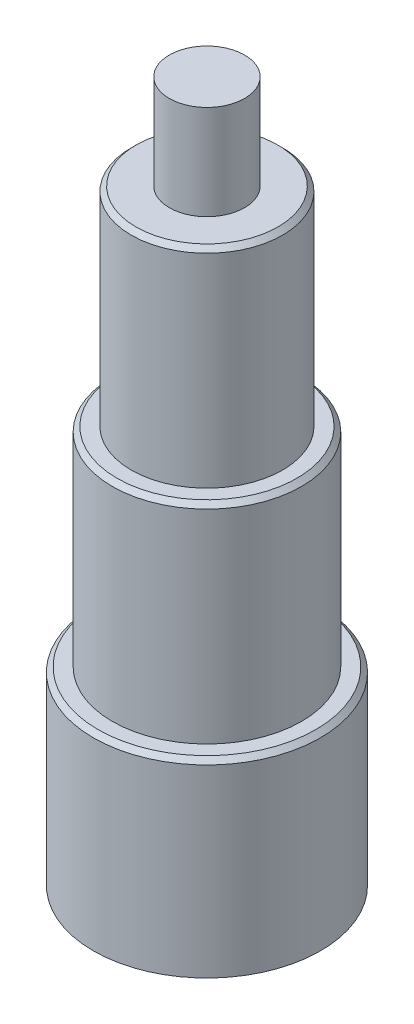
ISO-10303-21;
HEADER;
FILE_DESCRIPTION(('STEP AP214'),'2;1');
FILE_NAME('part.step','',(''),(''),'','','');
FILE_SCHEMA(('AUTOMOTIVE_DESIGN { 1 0 10303 214 1 1 1 1 }'));
ENDSEC;
DATA;
#1=APPLICATION_CONTEXT('core data for automotive mechanical design processes');
#2=APPLICATION_PROTOCOL_DEFINITION('international standard','automotive_design',2000,#1);
#3=PRODUCT_CONTEXT('',#1,'mechanical');
#4=PRODUCT('Part','Part','',(#3));
#5=PRODUCT_RELATED_PRODUCT_CATEGORY('part','',(#4));
#6=PRODUCT_DEFINITION_FORMATION('','',#4);
#7=PRODUCT_DEFINITION_CONTEXT('part definition',#1,'design');
#8=PRODUCT_DEFINITION('design','',#6,#7);
#9=PRODUCT_DEFINITION_SHAPE('','',#8);
#10=(LENGTH_UNIT() NAMED_UNIT(*) SI_UNIT(.MILLI.,.METRE.));
#11=(NAMED_UNIT(*) PLANE_ANGLE_UNIT() SI_UNIT($,.RADIAN.));
#12=(NAMED_UNIT(*) SI_UNIT($,.STERADIAN.) SOLID_ANGLE_UNIT());
#13=UNCERTAINTY_MEASURE_WITH_UNIT(LENGTH_MEASURE(1.E-05),#10,'distance_accuracy_value','');
#14=(GEOMETRIC_REPRESENTATION_CONTEXT(3) GLOBAL_UNCERTAINTY_ASSIGNED_CONTEXT((#13)) GLOBAL_UNIT_ASSIGNED_CONTEXT((#10,
#11,#12)) REPRESENTATION_CONTEXT('',''));
#15=CARTESIAN_POINT('',(0.,0.,0.));
#16=DIRECTION('',(0.,0.,1.));
#17=DIRECTION('',(1.,0.,0.));
#18=AXIS2_PLACEMENT_3D('',#15,#16,#17);
#19=CARTESIAN_POINT('',(0.,32.,0.));
#20=DIRECTION('',(0.,1.,0.));
#21=DIRECTION('',(0.,0.,1.));
#22=AXIS2_PLACEMENT_3D('',#19,#20,#21);
#23=PLANE('',#22);
#24=CARTESIAN_POINT('',(0.,32.,0.));
#25=DIRECTION('',(0.,1.,0.));
#26=DIRECTION('',(0.,0.,1.));
#27=AXIS2_PLACEMENT_3D('',#24,#25,#26);
#28=CIRCLE('',#27,3.75);
#29=CARTESIAN_POINT('',(0.,32.,3.75));
#30=VERTEX_POINT('',#29);
#31=EDGE_CURVE('E75',#30,#30,#28,.T.);
#32=ORIENTED_EDGE('',*,*,#31,.T.);
#33=EDGE_LOOP('',(#32));
#34=FACE_BOUND('',#33,.T.);
#35=CARTESIAN_POINT('',(0.,32.,0.));
#36=DIRECTION('',(0.,1.,0.));
#37=DIRECTION('',(0.,0.,1.));
#38=AXIS2_PLACEMENT_3D('',#35,#36,#37);
#39=CIRCLE('',#38,1.989);
#40=CARTESIAN_POINT('',(0.,32.,1.989));
#41=VERTEX_POINT('',#40);
#42=EDGE_CURVE('E55',#41,#41,#39,.T.);
#43=ORIENTED_EDGE('',*,*,#42,.F.);
#44=EDGE_LOOP('',(#43));
#45=FACE_BOUND('',#44,.T.);
#46=ADVANCED_FACE('F36',(#34,#45),#23,.T.);
#47=CARTESIAN_POINT('',(0.,21.,0.));
#48=DIRECTION('',(0.,1.,0.));
#49=DIRECTION('',(0.,0.,1.));
#50=AXIS2_PLACEMENT_3D('',#47,#48,#49);
#51=PLANE('',#50);
#52=CARTESIAN_POINT('',(0.,21.,0.));
#53=DIRECTION('',(0.,1.,0.));
#54=DIRECTION('',(0.,0.,1.));
#55=AXIS2_PLACEMENT_3D('',#52,#53,#54);
#56=CIRCLE('',#55,4.75);
#57=CARTESIAN_POINT('',(0.,21.,4.75));
#58=VERTEX_POINT('',#57);
#59=EDGE_CURVE('E81',#58,#58,#56,.T.);
#60=ORIENTED_EDGE('',*,*,#59,.T.);
#61=EDGE_LOOP('',(#60));
#62=FACE_BOUND('',#61,.T.);
#63=CARTESIAN_POINT('',(0.,21.,0.));
#64=DIRECTION('',(0.,1.,0.));
#65=DIRECTION('',(0.,0.,1.));
#66=AXIS2_PLACEMENT_3D('',#63,#64,#65);
#67=CIRCLE('',#66,4.);
#68=CARTESIAN_POINT('',(0.,21.,4.));
#69=VERTEX_POINT('',#68);
#70=EDGE_CURVE('E65',#69,#69,#67,.T.);
#71=ORIENTED_EDGE('',*,*,#70,.F.);
#72=EDGE_LOOP('',(#71));
#73=FACE_BOUND('',#72,.T.);
#74=ADVANCED_FACE('F102',(#62,#73),#51,.T.);
#75=CARTESIAN_POINT('',(0.,10.,0.));
#76=DIRECTION('',(0.,1.,0.));
#77=DIRECTION('',(0.,0.,1.));
#78=AXIS2_PLACEMENT_3D('',#75,#76,#77);
#79=PLANE('',#78);
#80=CARTESIAN_POINT('',(0.,10.,0.));
#81=DIRECTION('',(0.,1.,0.));
#82=DIRECTION('',(0.,0.,1.));
#83=AXIS2_PLACEMENT_3D('',#80,#81,#82);
#84=CIRCLE('',#83,5.75000000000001);
#85=CARTESIAN_POINT('',(0.,10.,5.75000000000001));
#86=VERTEX_POINT('',#85);
#87=EDGE_CURVE('E43',#86,#86,#84,.T.);
#88=ORIENTED_EDGE('',*,*,#87,.T.);
#89=EDGE_LOOP('',(#88));
#90=FACE_BOUND('',#89,.T.);
#91=CARTESIAN_POINT('',(0.,10.,0.));
#92=DIRECTION('',(0.,1.,0.));
#93=DIRECTION('',(0.,0.,1.));
#94=AXIS2_PLACEMENT_3D('',#91,#92,#93);
#95=CIRCLE('',#94,5.);
#96=CARTESIAN_POINT('',(0.,10.,5.));
#97=VERTEX_POINT('',#96);
#98=EDGE_CURVE('E69',#97,#97,#95,.T.);
#99=ORIENTED_EDGE('',*,*,#98,.F.);
#100=EDGE_LOOP('',(#99));
#101=FACE_BOUND('',#100,.T.);
#102=ADVANCED_FACE('F89',(#90,#101),#79,.T.);
#103=CARTESIAN_POINT('',(0.,10.,0.));
#104=DIRECTION('',(0.,-1.,0.));
#105=DIRECTION('',(0.,0.,-1.));
#106=AXIS2_PLACEMENT_3D('',#103,#104,#105);
#107=CYLINDRICAL_SURFACE('',#106,6.);
#108=CARTESIAN_POINT('',(0.,9.75,0.));
#109=DIRECTION('',(0.,1.,0.));
#110=DIRECTION('',(0.,0.,1.));
#111=AXIS2_PLACEMENT_3D('',#108,#109,#110);
#112=CIRCLE('',#111,6.);
#113=CARTESIAN_POINT('',(0.,9.75,6.));
#114=VERTEX_POINT('',#113);
#115=EDGE_CURVE('E11',#114,#114,#112,.F.);
#116=ORIENTED_EDGE('',*,*,#115,.T.);
#117=EDGE_LOOP('',(#116));
#118=FACE_BOUND('',#117,.T.);
#119=CARTESIAN_POINT('',(0.,0.,0.));
#120=DIRECTION('',(0.,1.,0.));
#121=DIRECTION('',(0.,0.,1.));
#122=AXIS2_PLACEMENT_3D('',#119,#120,#121);
#123=CIRCLE('',#122,6.);
#124=CARTESIAN_POINT('',(0.,0.,6.));
#125=VERTEX_POINT('',#124);
#126=EDGE_CURVE('E72',#125,#125,#123,.T.);
#127=ORIENTED_EDGE('',*,*,#126,.T.);
#128=EDGE_LOOP('',(#127));
#129=FACE_BOUND('',#128,.T.);
#130=ADVANCED_FACE('F126',(#118,#129),#107,.T.);
#131=CARTESIAN_POINT('',(0.,0.,0.));
#132=DIRECTION('',(0.,1.,0.));
#133=DIRECTION('',(0.,0.,1.));
#134=AXIS2_PLACEMENT_3D('',#131,#132,#133);
#135=PLANE('',#134);
#136=CARTESIAN_POINT('',(0.,0.,0.));
#137=DIRECTION('',(0.,-1.,0.));
#138=DIRECTION('',(0.,0.,-1.));
#139=AXIS2_PLACEMENT_3D('',#136,#137,#138);
#140=CIRCLE('',#139,1.64999999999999);
#141=CARTESIAN_POINT('',(0.,0.,-1.64999999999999));
#142=VERTEX_POINT('',#141);
#143=EDGE_CURVE('E56',#142,#142,#140,.T.);
#144=ORIENTED_EDGE('',*,*,#143,.F.);
#145=EDGE_LOOP('',(#144));
#146=FACE_BOUND('',#145,.T.);
#147=ORIENTED_EDGE('',*,*,#126,.F.);
#148=EDGE_LOOP('',(#147));
#149=FACE_BOUND('',#148,.T.);
#150=ADVANCED_FACE('F122',(#146,#149),#135,.F.);
#151=CARTESIAN_POINT('',(0.,21.,0.));
#152=DIRECTION('',(0.,-1.,0.));
#153=DIRECTION('',(0.,0.,-1.));
#154=AXIS2_PLACEMENT_3D('',#151,#152,#153);
#155=CYLINDRICAL_SURFACE('',#154,5.);
#156=CARTESIAN_POINT('',(0.,20.75,0.));
#157=DIRECTION('',(0.,1.,0.));
#158=DIRECTION('',(0.,0.,1.));
#159=AXIS2_PLACEMENT_3D('',#156,#157,#158);
#160=CIRCLE('',#159,5.);
#161=CARTESIAN_POINT('',(0.,20.75,5.));
#162=VERTEX_POINT('',#161);
#163=EDGE_CURVE('E84',#162,#162,#160,.F.);
#164=ORIENTED_EDGE('',*,*,#163,.T.);
#165=EDGE_LOOP('',(#164));
#166=FACE_BOUND('',#165,.T.);
#167=ORIENTED_EDGE('',*,*,#98,.T.);
#168=EDGE_LOOP('',(#167));
#169=FACE_BOUND('',#168,.T.);
#170=ADVANCED_FACE('F117',(#166,#169),#155,.T.);
#171=CARTESIAN_POINT('',(0.,32.,0.));
#172=DIRECTION('',(0.,-1.,0.));
#173=DIRECTION('',(0.,0.,-1.));
#174=AXIS2_PLACEMENT_3D('',#171,#172,#173);
#175=CYLINDRICAL_SURFACE('',#174,4.);
#176=CARTESIAN_POINT('',(0.,31.75,0.));
#177=DIRECTION('',(0.,1.,0.));
#178=DIRECTION('',(0.,0.,1.));
#179=AXIS2_PLACEMENT_3D('',#176,#177,#178);
#180=CIRCLE('',#179,4.);
#181=CARTESIAN_POINT('',(0.,31.75,4.));
#182=VERTEX_POINT('',#181);
#183=EDGE_CURVE('E78',#182,#182,#180,.F.);
#184=ORIENTED_EDGE('',*,*,#183,.T.);
#185=EDGE_LOOP('',(#184));
#186=FACE_BOUND('',#185,.T.);
#187=ORIENTED_EDGE('',*,*,#70,.T.);
#188=EDGE_LOOP('',(#187));
#189=FACE_BOUND('',#188,.T.);
#190=ADVANCED_FACE('F115',(#186,#189),#175,.T.);
#191=CARTESIAN_POINT('',(0.,37.,0.));
#192=DIRECTION('',(0.,-1.,0.));
#193=DIRECTION('',(0.,0.,-1.));
#194=AXIS2_PLACEMENT_3D('',#191,#192,#193);
#195=CYLINDRICAL_SURFACE('',#194,1.989);
#196=CARTESIAN_POINT('',(0.,37.,0.));
#197=DIRECTION('',(0.,1.,0.));
#198=DIRECTION('',(0.,0.,1.));
#199=AXIS2_PLACEMENT_3D('',#196,#197,#198);
#200=CIRCLE('',#199,1.989);
#201=CARTESIAN_POINT('',(0.,37.,1.989));
#202=VERTEX_POINT('',#201);
#203=EDGE_CURVE('E59',#202,#202,#200,.T.);
#204=ORIENTED_EDGE('',*,*,#203,.F.);
#205=EDGE_LOOP('',(#204));
#206=FACE_BOUND('',#205,.T.);
#207=ORIENTED_EDGE('',*,*,#42,.T.);
#208=EDGE_LOOP('',(#207));
#209=FACE_BOUND('',#208,.T.);
#210=ADVANCED_FACE('F113',(#206,#209),#195,.T.);
#211=CARTESIAN_POINT('',(0.,37.,0.));
#212=DIRECTION('',(0.,1.,0.));
#213=DIRECTION('',(0.,0.,1.));
#214=AXIS2_PLACEMENT_3D('',#211,#212,#213);
#215=PLANE('',#214);
#216=ORIENTED_EDGE('',*,*,#203,.T.);
#217=EDGE_LOOP('',(#216));
#218=FACE_BOUND('',#217,.T.);
#219=ADVANCED_FACE('F134',(#218),#215,.T.);
#220=CARTESIAN_POINT('',(0.,32.,0.));
#221=DIRECTION('',(0.,-1.,0.));
#222=DIRECTION('',(0.,0.,-1.));
#223=AXIS2_PLACEMENT_3D('',#220,#221,#222);
#224=CONICAL_SURFACE('',#223,3.75,0.785398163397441);
#225=ORIENTED_EDGE('',*,*,#183,.F.);
#226=EDGE_LOOP('',(#225));
#227=FACE_BOUND('',#226,.T.);
#228=ORIENTED_EDGE('',*,*,#31,.F.);
#229=EDGE_LOOP('',(#228));
#230=FACE_BOUND('',#229,.T.);
#231=ADVANCED_FACE('F98',(#227,#230),#224,.T.);
#232=CARTESIAN_POINT('',(0.,21.,0.));
#233=DIRECTION('',(0.,-1.,0.));
#234=DIRECTION('',(0.,0.,-1.));
#235=AXIS2_PLACEMENT_3D('',#232,#233,#234);
#236=CONICAL_SURFACE('',#235,4.75,0.785398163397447);
#237=ORIENTED_EDGE('',*,*,#163,.F.);
#238=EDGE_LOOP('',(#237));
#239=FACE_BOUND('',#238,.T.);
#240=ORIENTED_EDGE('',*,*,#59,.F.);
#241=EDGE_LOOP('',(#240));
#242=FACE_BOUND('',#241,.T.);
#243=ADVANCED_FACE('F93',(#239,#242),#236,.T.);
#244=CARTESIAN_POINT('',(0.,10.,0.));
#245=DIRECTION('',(0.,-1.,0.));
#246=DIRECTION('',(0.,0.,-1.));
#247=AXIS2_PLACEMENT_3D('',#244,#245,#246);
#248=CONICAL_SURFACE('',#247,5.75000000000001,0.78539816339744);
#249=ORIENTED_EDGE('',*,*,#115,.F.);
#250=EDGE_LOOP('',(#249));
#251=FACE_BOUND('',#250,.T.);
#252=ORIENTED_EDGE('',*,*,#87,.F.);
#253=EDGE_LOOP('',(#252));
#254=FACE_BOUND('',#253,.T.);
#255=ADVANCED_FACE('F38',(#251,#254),#248,.T.);
#256=CARTESIAN_POINT('',(0.,14.1,0.));
#257=DIRECTION('',(0.,-1.,0.));
#258=DIRECTION('',(0.,0.,-1.));
#259=AXIS2_PLACEMENT_3D('',#256,#257,#258);
#260=CONICAL_SURFACE('',#259,1.65,1.02974425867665);
#261=CARTESIAN_POINT('',(0.,15.0914200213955,0.));
#262=VERTEX_POINT('',#261);
#263=VERTEX_LOOP('',#262);
#264=FACE_BOUND('',#263,.T.);
#265=CARTESIAN_POINT('',(0.,14.1,0.));
#266=DIRECTION('',(0.,-1.,0.));
#267=DIRECTION('',(0.,0.,-1.));
#268=AXIS2_PLACEMENT_3D('',#265,#266,#267);
#269=CIRCLE('',#268,1.65);
#270=CARTESIAN_POINT('',(0.,14.1,-1.65));
#271=VERTEX_POINT('',#270);
#272=EDGE_CURVE('E53',#271,#271,#269,.T.);
#273=ORIENTED_EDGE('',*,*,#272,.T.);
#274=EDGE_LOOP('',(#273));
#275=FACE_BOUND('',#274,.T.);
#276=ADVANCED_FACE('F46',(#264,#275),#260,.F.);
#277=CARTESIAN_POINT('',(0.,0.,0.));
#278=DIRECTION('',(0.,-1.,0.));
#279=DIRECTION('',(0.,0.,-1.));
#280=AXIS2_PLACEMENT_3D('',#277,#278,#279);
#281=CYLINDRICAL_SURFACE('',#280,1.64999999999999);
#282=ORIENTED_EDGE('',*,*,#272,.F.);
#283=EDGE_LOOP('',(#282));
#284=FACE_BOUND('',#283,.T.);
#285=ORIENTED_EDGE('',*,*,#143,.T.);
#286=EDGE_LOOP('',(#285));
#287=FACE_BOUND('',#286,.T.);
#288=ADVANCED_FACE('F49',(#284,#287),#281,.F.);
#289=CLOSED_SHELL('',(#46,#74,#102,#130,#150,#170,#190,#210,#219,#231,#243,#255,#276,#288));
#290=MANIFOLD_SOLID_BREP('B2',#289);
#291=ADVANCED_BREP_SHAPE_REPRESENTATION('',(#18,#290),#14);
#292=SHAPE_DEFINITION_REPRESENTATION(#9,#291);
ENDSEC;
END-ISO-10303-21;
